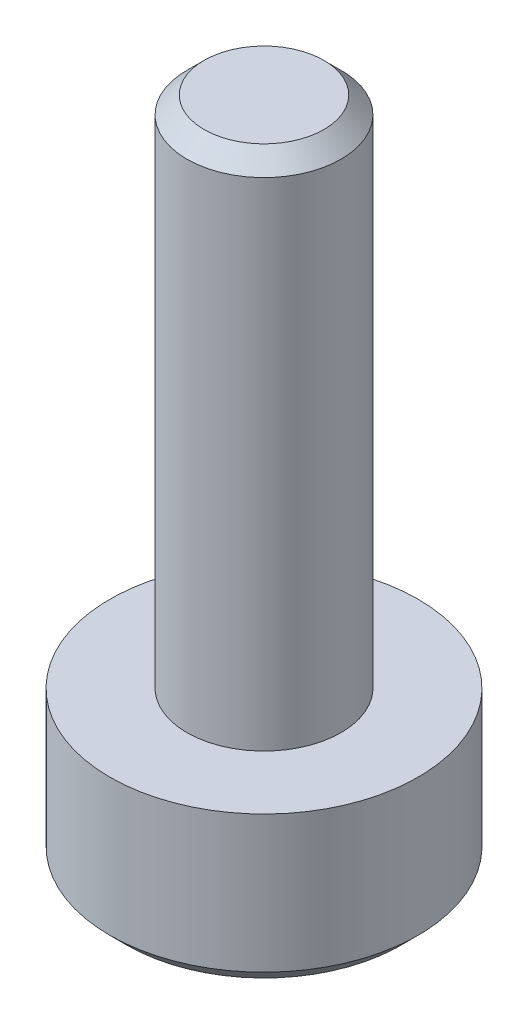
ISO-10303-21;
HEADER;
FILE_DESCRIPTION(('STEP AP214'),'2;1');
FILE_NAME('part.step','',(''),(''),'','','');
FILE_SCHEMA(('AUTOMOTIVE_DESIGN { 1 0 10303 214 1 1 1 1 }'));
ENDSEC;
DATA;
#1=APPLICATION_CONTEXT('core data for automotive mechanical design processes');
#2=APPLICATION_PROTOCOL_DEFINITION('international standard','automotive_design',2000,#1);
#3=PRODUCT_CONTEXT('',#1,'mechanical');
#4=PRODUCT('Part','Part','',(#3));
#5=PRODUCT_RELATED_PRODUCT_CATEGORY('part','',(#4));
#6=PRODUCT_DEFINITION_FORMATION('','',#4);
#7=PRODUCT_DEFINITION_CONTEXT('part definition',#1,'design');
#8=PRODUCT_DEFINITION('design','',#6,#7);
#9=PRODUCT_DEFINITION_SHAPE('','',#8);
#10=(LENGTH_UNIT() NAMED_UNIT(*) SI_UNIT(.MILLI.,.METRE.));
#11=(NAMED_UNIT(*) PLANE_ANGLE_UNIT() SI_UNIT($,.RADIAN.));
#12=(NAMED_UNIT(*) SI_UNIT($,.STERADIAN.) SOLID_ANGLE_UNIT());
#13=UNCERTAINTY_MEASURE_WITH_UNIT(LENGTH_MEASURE(1.E-05),#10,'distance_accuracy_value','');
#14=(GEOMETRIC_REPRESENTATION_CONTEXT(3) GLOBAL_UNCERTAINTY_ASSIGNED_CONTEXT((#13)) GLOBAL_UNIT_ASSIGNED_CONTEXT((#10,
#11,#12)) REPRESENTATION_CONTEXT('',''));
#15=CARTESIAN_POINT('',(0.,0.,0.));
#16=DIRECTION('',(0.,0.,1.));
#17=DIRECTION('',(1.,0.,0.));
#18=AXIS2_PLACEMENT_3D('',#15,#16,#17);
#19=CARTESIAN_POINT('',(0.,10.,0.));
#20=DIRECTION('',(0.,-1.,0.));
#21=DIRECTION('',(0.,0.,-1.));
#22=AXIS2_PLACEMENT_3D('',#19,#20,#21);
#23=CYLINDRICAL_SURFACE('',#22,1.5);
#24=CARTESIAN_POINT('',(0.,9.66666666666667,0.));
#25=DIRECTION('',(0.,1.,0.));
#26=DIRECTION('',(0.,0.,1.));
#27=AXIS2_PLACEMENT_3D('',#24,#25,#26);
#28=CIRCLE('',#27,1.5);
#29=CARTESIAN_POINT('',(0.,9.66666666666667,1.5));
#30=VERTEX_POINT('',#29);
#31=EDGE_CURVE('E160',#30,#30,#28,.F.);
#32=ORIENTED_EDGE('',*,*,#31,.T.);
#33=EDGE_LOOP('',(#32));
#34=FACE_BOUND('',#33,.T.);
#35=CARTESIAN_POINT('',(0.,0.,0.));
#36=DIRECTION('',(0.,1.,0.));
#37=DIRECTION('',(0.,0.,1.));
#38=AXIS2_PLACEMENT_3D('',#35,#36,#37);
#39=CIRCLE('',#38,1.5);
#40=CARTESIAN_POINT('',(0.,0.,1.5));
#41=VERTEX_POINT('',#40);
#42=EDGE_CURVE('E154',#41,#41,#39,.T.);
#43=ORIENTED_EDGE('',*,*,#42,.T.);
#44=EDGE_LOOP('',(#43));
#45=FACE_BOUND('',#44,.T.);
#46=ADVANCED_FACE('F43',(#34,#45),#23,.T.);
#47=CARTESIAN_POINT('',(0.,10.,0.));
#48=DIRECTION('',(0.,1.,0.));
#49=DIRECTION('',(0.,0.,1.));
#50=AXIS2_PLACEMENT_3D('',#47,#48,#49);
#51=PLANE('',#50);
#52=CARTESIAN_POINT('',(0.,10.,0.));
#53=DIRECTION('',(0.,1.,0.));
#54=DIRECTION('',(0.,0.,1.));
#55=AXIS2_PLACEMENT_3D('',#52,#53,#54);
#56=CIRCLE('',#55,1.16666666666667);
#57=CARTESIAN_POINT('',(0.,10.,1.16666666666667));
#58=VERTEX_POINT('',#57);
#59=EDGE_CURVE('E157',#58,#58,#56,.T.);
#60=ORIENTED_EDGE('',*,*,#59,.T.);
#61=EDGE_LOOP('',(#60));
#62=FACE_BOUND('',#61,.T.);
#63=ADVANCED_FACE('F177',(#62),#51,.T.);
#64=CARTESIAN_POINT('',(0.,-3.,0.));
#65=DIRECTION('',(0.,1.,0.));
#66=DIRECTION('',(0.,0.,1.));
#67=AXIS2_PLACEMENT_3D('',#64,#65,#66);
#68=CYLINDRICAL_SURFACE('',#67,3.);
#69=CARTESIAN_POINT('',(0.,-2.66666666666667,0.));
#70=DIRECTION('',(0.,-1.,0.));
#71=DIRECTION('',(0.,0.,-1.));
#72=AXIS2_PLACEMENT_3D('',#69,#70,#71);
#73=CIRCLE('',#72,3.);
#74=CARTESIAN_POINT('',(0.,-2.66666666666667,3.));
#75=VERTEX_POINT('',#74);
#76=EDGE_CURVE('E11',#75,#75,#73,.F.);
#77=ORIENTED_EDGE('',*,*,#76,.T.);
#78=EDGE_LOOP('',(#77));
#79=FACE_BOUND('',#78,.T.);
#80=CARTESIAN_POINT('',(0.,0.,0.));
#81=DIRECTION('',(0.,-1.,0.));
#82=DIRECTION('',(0.,0.,-1.));
#83=AXIS2_PLACEMENT_3D('',#80,#81,#82);
#84=CIRCLE('',#83,3.);
#85=CARTESIAN_POINT('',(0.,0.,-3.));
#86=VERTEX_POINT('',#85);
#87=EDGE_CURVE('E146',#86,#86,#84,.T.);
#88=ORIENTED_EDGE('',*,*,#87,.T.);
#89=EDGE_LOOP('',(#88));
#90=FACE_BOUND('',#89,.T.);
#91=ADVANCED_FACE('F183',(#79,#90),#68,.T.);
#92=CARTESIAN_POINT('',(0.,-3.,0.));
#93=DIRECTION('',(0.,-1.,0.));
#94=DIRECTION('',(0.,0.,-1.));
#95=AXIS2_PLACEMENT_3D('',#92,#93,#94);
#96=PLANE('',#95);
#97=CARTESIAN_POINT('',(0.,-3.,0.));
#98=DIRECTION('',(0.,-1.,0.));
#99=DIRECTION('',(0.,0.,-1.));
#100=AXIS2_PLACEMENT_3D('',#97,#98,#99);
#101=CIRCLE('',#100,2.66666666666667);
#102=CARTESIAN_POINT('',(0.,-3.,2.66666666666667));
#103=VERTEX_POINT('',#102);
#104=EDGE_CURVE('E52',#103,#103,#101,.T.);
#105=ORIENTED_EDGE('',*,*,#104,.T.);
#106=EDGE_LOOP('',(#105));
#107=FACE_BOUND('',#106,.T.);
#108=DIRECTION('',(-0.866025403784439,0.,0.5));
#109=VECTOR('',#108,1.);
#110=CARTESIAN_POINT('',(1.5,-3.,0.86602540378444));
#111=LINE('',#110,#109);
#112=CARTESIAN_POINT('',(1.5,-3.,0.86602540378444));
#113=VERTEX_POINT('',#112);
#114=CARTESIAN_POINT('',(0.,-3.,1.73205080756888));
#115=VERTEX_POINT('',#114);
#116=EDGE_CURVE('E59',#113,#115,#111,.T.);
#117=ORIENTED_EDGE('',*,*,#116,.F.);
#118=DIRECTION('',(0.,0.,1.));
#119=VECTOR('',#118,1.);
#120=CARTESIAN_POINT('',(1.5,-3.,-0.866025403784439));
#121=LINE('',#120,#119);
#122=CARTESIAN_POINT('',(1.5,-3.,-0.866025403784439));
#123=VERTEX_POINT('',#122);
#124=EDGE_CURVE('E142',#123,#113,#121,.T.);
#125=ORIENTED_EDGE('',*,*,#124,.F.);
#126=DIRECTION('',(0.866025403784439,0.,0.5));
#127=VECTOR('',#126,1.);
#128=CARTESIAN_POINT('',(0.,-3.,-1.73205080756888));
#129=LINE('',#128,#127);
#130=CARTESIAN_POINT('',(0.,-3.,-1.73205080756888));
#131=VERTEX_POINT('',#130);
#132=EDGE_CURVE('E140',#131,#123,#129,.T.);
#133=ORIENTED_EDGE('',*,*,#132,.F.);
#134=DIRECTION('',(0.866025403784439,0.,-0.5));
#135=VECTOR('',#134,1.);
#136=CARTESIAN_POINT('',(-1.5,-3.,-0.866025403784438));
#137=LINE('',#136,#135);
#138=CARTESIAN_POINT('',(-1.5,-3.,-0.866025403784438));
#139=VERTEX_POINT('',#138);
#140=EDGE_CURVE('E107',#139,#131,#137,.T.);
#141=ORIENTED_EDGE('',*,*,#140,.F.);
#142=DIRECTION('',(0.,0.,-1.));
#143=VECTOR('',#142,1.);
#144=CARTESIAN_POINT('',(-1.5,-3.,0.86602540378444));
#145=LINE('',#144,#143);
#146=CARTESIAN_POINT('',(-1.5,-3.,0.86602540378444));
#147=VERTEX_POINT('',#146);
#148=EDGE_CURVE('E136',#147,#139,#145,.T.);
#149=ORIENTED_EDGE('',*,*,#148,.F.);
#150=DIRECTION('',(-0.866025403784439,0.,-0.5));
#151=VECTOR('',#150,1.);
#152=CARTESIAN_POINT('',(0.,-3.,1.73205080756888));
#153=LINE('',#152,#151);
#154=EDGE_CURVE('E133',#115,#147,#153,.T.);
#155=ORIENTED_EDGE('',*,*,#154,.F.);
#156=EDGE_LOOP('',(#117,#125,#133,#141,#149,#155));
#157=FACE_BOUND('',#156,.T.);
#158=ADVANCED_FACE('F165',(#107,#157),#96,.T.);
#159=CARTESIAN_POINT('',(0.,0.,0.));
#160=DIRECTION('',(0.,-1.,0.));
#161=DIRECTION('',(0.,0.,-1.));
#162=AXIS2_PLACEMENT_3D('',#159,#160,#161);
#163=PLANE('',#162);
#164=ORIENTED_EDGE('',*,*,#42,.F.);
#165=EDGE_LOOP('',(#164));
#166=FACE_BOUND('',#165,.T.);
#167=ORIENTED_EDGE('',*,*,#87,.F.);
#168=EDGE_LOOP('',(#167));
#169=FACE_BOUND('',#168,.T.);
#170=ADVANCED_FACE('F196',(#166,#169),#163,.F.);
#171=CARTESIAN_POINT('',(1.5,-1.,0.86602540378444));
#172=DIRECTION('',(0.5,0.,0.866025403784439));
#173=DIRECTION('',(0.866025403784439,0.,-0.5));
#174=AXIS2_PLACEMENT_3D('',#171,#172,#173);
#175=PLANE('',#174);
#176=ORIENTED_EDGE('',*,*,#116,.T.);
#177=DIRECTION('',(0.,-1.,0.));
#178=VECTOR('',#177,1.);
#179=CARTESIAN_POINT('',(0.,-1.,1.73205080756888));
#180=LINE('',#179,#178);
#181=CARTESIAN_POINT('',(0.,-1.,1.73205080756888));
#182=VERTEX_POINT('',#181);
#183=EDGE_CURVE('E89',#182,#115,#180,.T.);
#184=ORIENTED_EDGE('',*,*,#183,.F.);
#185=DIRECTION('',(-0.866025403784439,0.,0.5));
#186=VECTOR('',#185,1.);
#187=CARTESIAN_POINT('',(1.5,-1.,0.86602540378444));
#188=LINE('',#187,#186);
#189=CARTESIAN_POINT('',(1.5,-1.,0.86602540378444));
#190=VERTEX_POINT('',#189);
#191=EDGE_CURVE('E144',#190,#182,#188,.T.);
#192=ORIENTED_EDGE('',*,*,#191,.F.);
#193=DIRECTION('',(0.,-1.,0.));
#194=VECTOR('',#193,1.);
#195=CARTESIAN_POINT('',(1.5,-1.,0.86602540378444));
#196=LINE('',#195,#194);
#197=EDGE_CURVE('E67',#190,#113,#196,.T.);
#198=ORIENTED_EDGE('',*,*,#197,.T.);
#199=EDGE_LOOP('',(#176,#184,#192,#198));
#200=FACE_BOUND('',#199,.T.);
#201=ADVANCED_FACE('F199',(#200),#175,.F.);
#202=CARTESIAN_POINT('',(1.5,-1.,-0.866025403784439));
#203=DIRECTION('',(1.,0.,0.));
#204=DIRECTION('',(0.,0.,-1.));
#205=AXIS2_PLACEMENT_3D('',#202,#203,#204);
#206=PLANE('',#205);
#207=ORIENTED_EDGE('',*,*,#124,.T.);
#208=ORIENTED_EDGE('',*,*,#197,.F.);
#209=DIRECTION('',(0.,0.,1.));
#210=VECTOR('',#209,1.);
#211=CARTESIAN_POINT('',(1.5,-1.,-0.866025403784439));
#212=LINE('',#211,#210);
#213=CARTESIAN_POINT('',(1.5,-1.,-0.866025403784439));
#214=VERTEX_POINT('',#213);
#215=EDGE_CURVE('E119',#214,#190,#212,.T.);
#216=ORIENTED_EDGE('',*,*,#215,.F.);
#217=DIRECTION('',(0.,-1.,0.));
#218=VECTOR('',#217,1.);
#219=CARTESIAN_POINT('',(1.5,-1.,-0.866025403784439));
#220=LINE('',#219,#218);
#221=EDGE_CURVE('E111',#214,#123,#220,.T.);
#222=ORIENTED_EDGE('',*,*,#221,.T.);
#223=EDGE_LOOP('',(#207,#208,#216,#222));
#224=FACE_BOUND('',#223,.T.);
#225=ADVANCED_FACE('F205',(#224),#206,.F.);
#226=CARTESIAN_POINT('',(0.,-1.,-1.73205080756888));
#227=DIRECTION('',(0.5,0.,-0.866025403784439));
#228=DIRECTION('',(-0.866025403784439,0.,-0.5));
#229=AXIS2_PLACEMENT_3D('',#226,#227,#228);
#230=PLANE('',#229);
#231=ORIENTED_EDGE('',*,*,#132,.T.);
#232=ORIENTED_EDGE('',*,*,#221,.F.);
#233=DIRECTION('',(0.866025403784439,0.,0.5));
#234=VECTOR('',#233,1.);
#235=CARTESIAN_POINT('',(0.,-1.,-1.73205080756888));
#236=LINE('',#235,#234);
#237=CARTESIAN_POINT('',(0.,-1.,-1.73205080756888));
#238=VERTEX_POINT('',#237);
#239=EDGE_CURVE('E115',#238,#214,#236,.T.);
#240=ORIENTED_EDGE('',*,*,#239,.F.);
#241=DIRECTION('',(0.,-1.,0.));
#242=VECTOR('',#241,1.);
#243=CARTESIAN_POINT('',(0.,-1.,-1.73205080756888));
#244=LINE('',#243,#242);
#245=EDGE_CURVE('E100',#238,#131,#244,.T.);
#246=ORIENTED_EDGE('',*,*,#245,.T.);
#247=EDGE_LOOP('',(#231,#232,#240,#246));
#248=FACE_BOUND('',#247,.T.);
#249=ADVANCED_FACE('F116',(#248),#230,.F.);
#250=CARTESIAN_POINT('',(-1.5,-1.,-0.866025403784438));
#251=DIRECTION('',(-0.5,0.,-0.866025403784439));
#252=DIRECTION('',(-0.866025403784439,0.,0.5));
#253=AXIS2_PLACEMENT_3D('',#250,#251,#252);
#254=PLANE('',#253);
#255=ORIENTED_EDGE('',*,*,#140,.T.);
#256=ORIENTED_EDGE('',*,*,#245,.F.);
#257=DIRECTION('',(0.866025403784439,0.,-0.5));
#258=VECTOR('',#257,1.);
#259=CARTESIAN_POINT('',(-1.5,-1.,-0.866025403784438));
#260=LINE('',#259,#258);
#261=CARTESIAN_POINT('',(-1.5,-1.,-0.866025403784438));
#262=VERTEX_POINT('',#261);
#263=EDGE_CURVE('E104',#262,#238,#260,.T.);
#264=ORIENTED_EDGE('',*,*,#263,.F.);
#265=DIRECTION('',(0.,-1.,0.));
#266=VECTOR('',#265,1.);
#267=CARTESIAN_POINT('',(-1.5,-1.,-0.866025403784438));
#268=LINE('',#267,#266);
#269=EDGE_CURVE('E112',#262,#139,#268,.T.);
#270=ORIENTED_EDGE('',*,*,#269,.T.);
#271=EDGE_LOOP('',(#255,#256,#264,#270));
#272=FACE_BOUND('',#271,.T.);
#273=ADVANCED_FACE('F102',(#272),#254,.F.);
#274=CARTESIAN_POINT('',(-1.5,-1.,0.86602540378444));
#275=DIRECTION('',(-1.,0.,0.));
#276=DIRECTION('',(0.,0.,1.));
#277=AXIS2_PLACEMENT_3D('',#274,#275,#276);
#278=PLANE('',#277);
#279=ORIENTED_EDGE('',*,*,#148,.T.);
#280=ORIENTED_EDGE('',*,*,#269,.F.);
#281=DIRECTION('',(0.,0.,-1.));
#282=VECTOR('',#281,1.);
#283=CARTESIAN_POINT('',(-1.5,-1.,0.86602540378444));
#284=LINE('',#283,#282);
#285=CARTESIAN_POINT('',(-1.5,-1.,0.86602540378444));
#286=VERTEX_POINT('',#285);
#287=EDGE_CURVE('E125',#286,#262,#284,.T.);
#288=ORIENTED_EDGE('',*,*,#287,.F.);
#289=DIRECTION('',(0.,-1.,0.));
#290=VECTOR('',#289,1.);
#291=CARTESIAN_POINT('',(-1.5,-1.,0.86602540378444));
#292=LINE('',#291,#290);
#293=EDGE_CURVE('E149',#286,#147,#292,.T.);
#294=ORIENTED_EDGE('',*,*,#293,.T.);
#295=EDGE_LOOP('',(#279,#280,#288,#294));
#296=FACE_BOUND('',#295,.T.);
#297=ADVANCED_FACE('F209',(#296),#278,.F.);
#298=CARTESIAN_POINT('',(0.,-1.,1.73205080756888));
#299=DIRECTION('',(-0.5,0.,0.866025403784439));
#300=DIRECTION('',(0.866025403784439,0.,0.5));
#301=AXIS2_PLACEMENT_3D('',#298,#299,#300);
#302=PLANE('',#301);
#303=ORIENTED_EDGE('',*,*,#154,.T.);
#304=ORIENTED_EDGE('',*,*,#293,.F.);
#305=DIRECTION('',(-0.866025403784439,0.,-0.5));
#306=VECTOR('',#305,1.);
#307=CARTESIAN_POINT('',(0.,-1.,1.73205080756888));
#308=LINE('',#307,#306);
#309=EDGE_CURVE('E127',#182,#286,#308,.T.);
#310=ORIENTED_EDGE('',*,*,#309,.F.);
#311=ORIENTED_EDGE('',*,*,#183,.T.);
#312=EDGE_LOOP('',(#303,#304,#310,#311));
#313=FACE_BOUND('',#312,.T.);
#314=ADVANCED_FACE('F206',(#313),#302,.F.);
#315=CARTESIAN_POINT('',(0.,-1.,0.));
#316=DIRECTION('',(0.,-1.,0.));
#317=DIRECTION('',(0.,0.,-1.));
#318=AXIS2_PLACEMENT_3D('',#315,#316,#317);
#319=PLANE('',#318);
#320=ORIENTED_EDGE('',*,*,#191,.T.);
#321=ORIENTED_EDGE('',*,*,#309,.T.);
#322=ORIENTED_EDGE('',*,*,#287,.T.);
#323=ORIENTED_EDGE('',*,*,#263,.T.);
#324=ORIENTED_EDGE('',*,*,#239,.T.);
#325=ORIENTED_EDGE('',*,*,#215,.T.);
#326=EDGE_LOOP('',(#320,#321,#322,#323,#324,#325));
#327=FACE_BOUND('',#326,.T.);
#328=ADVANCED_FACE('F122',(#327),#319,.T.);
#329=CARTESIAN_POINT('',(0.,10.,0.));
#330=DIRECTION('',(0.,-1.,0.));
#331=DIRECTION('',(0.,0.,-1.));
#332=AXIS2_PLACEMENT_3D('',#329,#330,#331);
#333=CONICAL_SURFACE('',#332,1.16666666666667,0.785398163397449);
#334=ORIENTED_EDGE('',*,*,#31,.F.);
#335=EDGE_LOOP('',(#334));
#336=FACE_BOUND('',#335,.T.);
#337=ORIENTED_EDGE('',*,*,#59,.F.);
#338=EDGE_LOOP('',(#337));
#339=FACE_BOUND('',#338,.T.);
#340=ADVANCED_FACE('F169',(#336,#339),#333,.T.);
#341=CARTESIAN_POINT('',(0.,-3.,0.));
#342=DIRECTION('',(0.,1.,0.));
#343=DIRECTION('',(0.,0.,1.));
#344=AXIS2_PLACEMENT_3D('',#341,#342,#343);
#345=CONICAL_SURFACE('',#344,2.66666666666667,0.785398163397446);
#346=CARTESIAN_POINT('',(0.,-2.66666666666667,3.));
#347=CARTESIAN_POINT('',(0.,-2.67013888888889,2.99652777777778));
#348=CARTESIAN_POINT('',(0.,-2.67361111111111,2.99305555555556));
#349=CARTESIAN_POINT('',(0.,-2.68055555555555,2.98611111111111));
#350=CARTESIAN_POINT('',(0.,-2.68402777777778,2.98263888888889));
#351=CARTESIAN_POINT('',(0.,-2.69097222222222,2.97569444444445));
#352=CARTESIAN_POINT('',(0.,-2.69444444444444,2.97222222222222));
#353=CARTESIAN_POINT('',(0.,-2.70138888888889,2.96527777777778));
#354=CARTESIAN_POINT('',(0.,-2.70486111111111,2.96180555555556));
#355=CARTESIAN_POINT('',(0.,-2.71180555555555,2.95486111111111));
#356=CARTESIAN_POINT('',(0.,-2.71527777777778,2.95138888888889));
#357=CARTESIAN_POINT('',(0.,-2.72222222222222,2.94444444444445));
#358=CARTESIAN_POINT('',(0.,-2.72569444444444,2.94097222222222));
#359=CARTESIAN_POINT('',(0.,-2.73263888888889,2.93402777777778));
#360=CARTESIAN_POINT('',(0.,-2.73611111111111,2.93055555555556));
#361=CARTESIAN_POINT('',(0.,-2.74305555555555,2.92361111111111));
#362=CARTESIAN_POINT('',(0.,-2.74652777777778,2.92013888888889));
#363=CARTESIAN_POINT('',(0.,-2.75347222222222,2.91319444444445));
#364=CARTESIAN_POINT('',(0.,-2.75694444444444,2.90972222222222));
#365=CARTESIAN_POINT('',(0.,-2.76388888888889,2.90277777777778));
#366=CARTESIAN_POINT('',(0.,-2.76736111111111,2.89930555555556));
#367=CARTESIAN_POINT('',(0.,-2.77430555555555,2.89236111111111));
#368=CARTESIAN_POINT('',(0.,-2.77777777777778,2.88888888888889));
#369=CARTESIAN_POINT('',(0.,-2.78472222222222,2.88194444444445));
#370=CARTESIAN_POINT('',(0.,-2.78819444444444,2.87847222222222));
#371=CARTESIAN_POINT('',(0.,-2.79513888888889,2.87152777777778));
#372=CARTESIAN_POINT('',(0.,-2.79861111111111,2.86805555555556));
#373=CARTESIAN_POINT('',(0.,-2.80555555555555,2.86111111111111));
#374=CARTESIAN_POINT('',(0.,-2.80902777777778,2.85763888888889));
#375=CARTESIAN_POINT('',(0.,-2.81597222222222,2.85069444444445));
#376=CARTESIAN_POINT('',(0.,-2.81944444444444,2.84722222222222));
#377=CARTESIAN_POINT('',(0.,-2.82638888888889,2.84027777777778));
#378=CARTESIAN_POINT('',(0.,-2.82986111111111,2.83680555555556));
#379=CARTESIAN_POINT('',(0.,-2.83680555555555,2.82986111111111));
#380=CARTESIAN_POINT('',(0.,-2.84027777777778,2.82638888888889));
#381=CARTESIAN_POINT('',(0.,-2.84722222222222,2.81944444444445));
#382=CARTESIAN_POINT('',(0.,-2.85069444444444,2.81597222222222));
#383=CARTESIAN_POINT('',(0.,-2.85763888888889,2.80902777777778));
#384=CARTESIAN_POINT('',(0.,-2.86111111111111,2.80555555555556));
#385=CARTESIAN_POINT('',(0.,-2.86805555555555,2.79861111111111));
#386=CARTESIAN_POINT('',(0.,-2.87152777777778,2.79513888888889));
#387=CARTESIAN_POINT('',(0.,-2.87847222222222,2.78819444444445));
#388=CARTESIAN_POINT('',(0.,-2.88194444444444,2.78472222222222));
#389=CARTESIAN_POINT('',(0.,-2.88888888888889,2.77777777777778));
#390=CARTESIAN_POINT('',(0.,-2.89236111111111,2.77430555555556));
#391=CARTESIAN_POINT('',(0.,-2.89930555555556,2.76736111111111));
#392=CARTESIAN_POINT('',(0.,-2.90277777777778,2.76388888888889));
#393=CARTESIAN_POINT('',(0.,-2.90972222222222,2.75694444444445));
#394=CARTESIAN_POINT('',(0.,-2.91319444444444,2.75347222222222));
#395=CARTESIAN_POINT('',(0.,-2.92013888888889,2.74652777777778));
#396=CARTESIAN_POINT('',(0.,-2.92361111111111,2.74305555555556));
#397=CARTESIAN_POINT('',(0.,-2.93055555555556,2.73611111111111));
#398=CARTESIAN_POINT('',(0.,-2.93402777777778,2.73263888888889));
#399=CARTESIAN_POINT('',(0.,-2.94097222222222,2.72569444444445));
#400=CARTESIAN_POINT('',(0.,-2.94444444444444,2.72222222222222));
#401=CARTESIAN_POINT('',(0.,-2.95138888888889,2.71527777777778));
#402=CARTESIAN_POINT('',(0.,-2.95486111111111,2.71180555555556));
#403=CARTESIAN_POINT('',(0.,-2.96180555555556,2.70486111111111));
#404=CARTESIAN_POINT('',(0.,-2.96527777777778,2.70138888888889));
#405=CARTESIAN_POINT('',(0.,-2.97222222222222,2.69444444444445));
#406=CARTESIAN_POINT('',(0.,-2.97569444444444,2.69097222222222));
#407=CARTESIAN_POINT('',(0.,-2.98263888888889,2.68402777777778));
#408=CARTESIAN_POINT('',(0.,-2.98611111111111,2.68055555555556));
#409=CARTESIAN_POINT('',(0.,-2.99305555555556,2.67361111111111));
#410=CARTESIAN_POINT('',(0.,-2.99652777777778,2.67013888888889));
#411=CARTESIAN_POINT('',(0.,-3.,2.66666666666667));
#412=B_SPLINE_CURVE_WITH_KNOTS('',3,(#346,#347,#348,#349,#350,#351,#352,#353,#354,#355,#356,
#357,#358,#359,#360,#361,#362,#363,#364,#365,#366,#367,#368,#369,#370,#371,#372,#373,#374,#375,
#376,#377,#378,#379,#380,#381,#382,#383,#384,#385,#386,#387,#388,#389,#390,#391,#392,#393,#394,
#395,#396,#397,#398,#399,#400,#401,#402,#403,#404,#405,#406,#407,#408,#409,#410,#411),
.UNSPECIFIED.,.F.,.F.,(4,2,2,2,2,2,2,2,2,2,2,2,2,2,2,2,2,2,2,2,2,2,2,2,2,2,2,2,2,2,2,2,4),(0.,
0.01473139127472,0.0294627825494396,0.0441941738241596,0.0589255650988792,0.0736569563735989,
0.0883883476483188,0.103119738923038,0.117851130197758,0.132582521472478,0.147313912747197,
0.162045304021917,0.176776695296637,0.191508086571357,0.206239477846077,0.220970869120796,
0.235702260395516,0.250433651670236,0.265165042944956,0.279896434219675,0.294627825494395,
0.309359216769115,0.324090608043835,0.338821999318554,0.353553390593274,0.368284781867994,
0.383016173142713,0.397747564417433,0.412478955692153,0.427210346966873,0.441941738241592,
0.456673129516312,0.471404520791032),.UNSPECIFIED.);
#413=EDGE_CURVE('BSEAM46',#75,#103,#412,.T.);
#414=ORIENTED_EDGE('',*,*,#76,.F.);
#415=ORIENTED_EDGE('',*,*,#104,.F.);
#416=ORIENTED_EDGE('',*,*,#413,.T.);
#417=ORIENTED_EDGE('',*,*,#413,.F.);
#418=EDGE_LOOP('',(#414,#416,#415,#417));
#419=FACE_BOUND('',#418,.T.);
#420=ADVANCED_FACE('F46',(#419),#345,.T.);
#421=CLOSED_SHELL('',(#46,#63,#91,#158,#170,#201,#225,#249,#273,#297,#314,#328,#340,#420));
#422=MANIFOLD_SOLID_BREP('B2',#421);
#423=ADVANCED_BREP_SHAPE_REPRESENTATION('',(#18,#422),#14);
#424=SHAPE_DEFINITION_REPRESENTATION(#9,#423);
ENDSEC;
END-ISO-10303-21;
